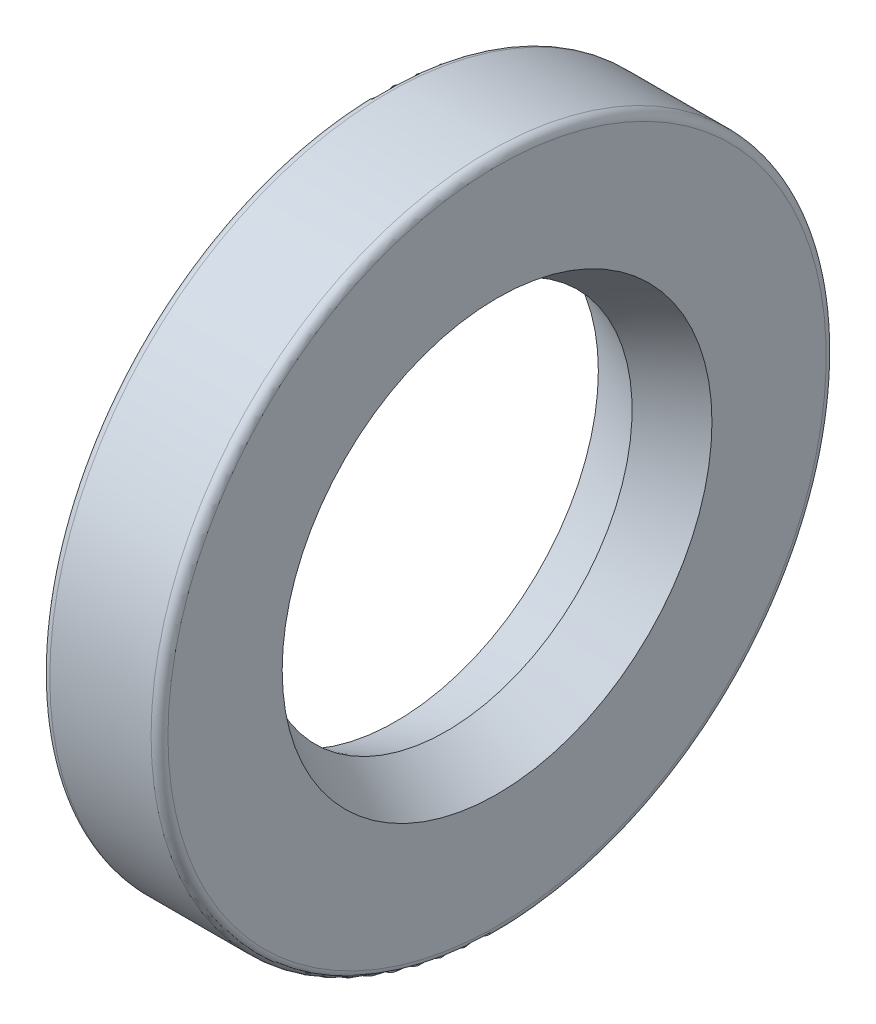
from build123d import *

# Parameters (mm, degrees)
CONG_1_R = 0.5


with BuildPart() as part:
    # Esquisse1 → R_volution1 (revolve)
    with BuildSketch(Plane.XY, mode=Mode.PRIVATE) as r_volution1_sk:
        with BuildLine():
            Line((0, 18), (0, 20))
            Line((0, 20), (7, 20))
            Line((7, 20), (7, 12.732050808))
            Line((7, 12.732050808), (4, 11))
            Line((4, 11), (1, 12))
            Line((1, 12), (1, 14))
            Line((1, 14), (2, 14))
            ThreePointArc((2, 14), (3, 15), (4, 14))
            Line((4, 14), (5, 14))
            Line((5, 14), (5, 18))
            Line((5, 18), (0, 18))
        make_face()
    revolve(r_volution1_sk.sketch.rotate(Axis((-16.715747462, 0, 0), (1, 0, 0)), 90), axis=Axis((-16.715747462, 0, 0), (1, 0, 0)))

    # Cong_1
    cong_1_edges = [part.edges().sort_by_distance(p)[0] for p in [
        (0, 0, -20),
        (7, 0, -20),
    ]]
    fillet(cong_1_edges, radius=CONG_1_R)


solid = part.part
